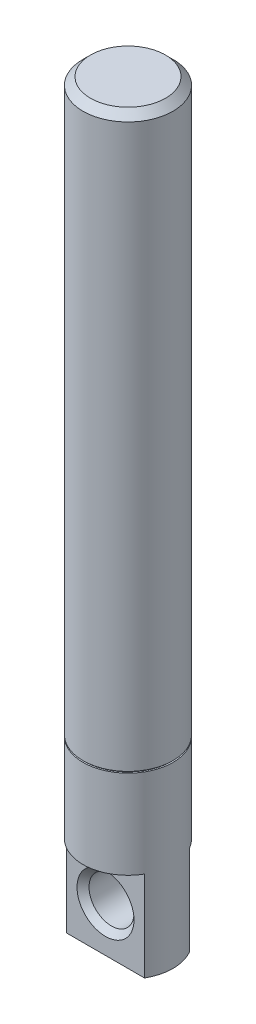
from build123d import *

# Parameters (mm, degrees)
SKETCH1_R               = 1.5
EXTRUDE1_DEPTH          = 25
CHAMFER1_SIZE           = 0.25
CUT_EXTRUDE1_DEPTH      = 3
SKETCH3_W               = 0.870716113
SKETCH3_H               = 0.05
CUT_EXTRUDE2_DEPTH      = 26.089838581
CUT_EXTRUDE2_DEPTH_BACK = 26.089838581
SKETCH4_R               = 0.75
CHAMFER2_SIZE           = 0.2


with BuildPart() as part:
    # Sketch1 → Extrude1 (new body)
    with BuildSketch(Plane(origin=(0, 0, 0), x_dir=(1, 0, 0), z_dir=(0, 1, 0))):
        with Locations(Location((0, 0, 0), (0, 0, 270))):
            Circle(SKETCH1_R)
    extrude(amount=EXTRUDE1_DEPTH)

    # Chamfer1
    chamfer1_edges = [part.edges().sort_by_distance(p)[0] for p in [
        (0, 25, -1.5),
    ]]
    chamfer(chamfer1_edges, length=CHAMFER1_SIZE)

    # Sketch2 → Cut-Extrude1 (cut)
    with BuildSketch(Plane.XZ):
        with BuildLine():
            Line((1.299038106, -0.75), (-1.299038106, -0.75))
            ThreePointArc((-1.299038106, -0.75), (0, -1.5), (1.299038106, -0.75))
        make_face()
    cut_extrude1 = extrude(amount=-CUT_EXTRUDE1_DEPTH, mode=Mode.SUBTRACT)

    # Mirror1: Cut-Extrude1 across plane
    add(cut_extrude1.mirror(Plane.XY), mode=Mode.SUBTRACT)

    # Sketch3 → Cut-Revolve1 (revolve, cut)
    with BuildSketch(Plane.XY, mode=Mode.PRIVATE) as cut_revolve1_sk:
        with Locations((1.885358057, 5.975)):
            Rectangle(SKETCH3_W, SKETCH3_H)
    revolve(cut_revolve1_sk.sketch.rotate(Axis((0, 0, 0), (0, 1, 0)), 90), axis=Axis((0, 0, 0), (0, 1, 0)), mode=Mode.SUBTRACT)

    # Sketch4 → Cut-Extrude2 (cut, two sides: drawn at the far end of the back side and taken through both)
    with BuildSketch(Plane.XY.offset(-CUT_EXTRUDE2_DEPTH_BACK)):
        with Locations((0, 1.5)):
            Circle(SKETCH4_R)
    extrude(amount=CUT_EXTRUDE2_DEPTH + CUT_EXTRUDE2_DEPTH_BACK, mode=Mode.SUBTRACT)

    # Chamfer2
    chamfer2_edges = [part.edges().sort_by_distance(p)[0] for p in [
        (-0.75, 1.5, -0.75),
        (-0.75, 1.5, 0.75),
    ]]
    chamfer(chamfer2_edges, length=CHAMFER2_SIZE)


solid = part.part
